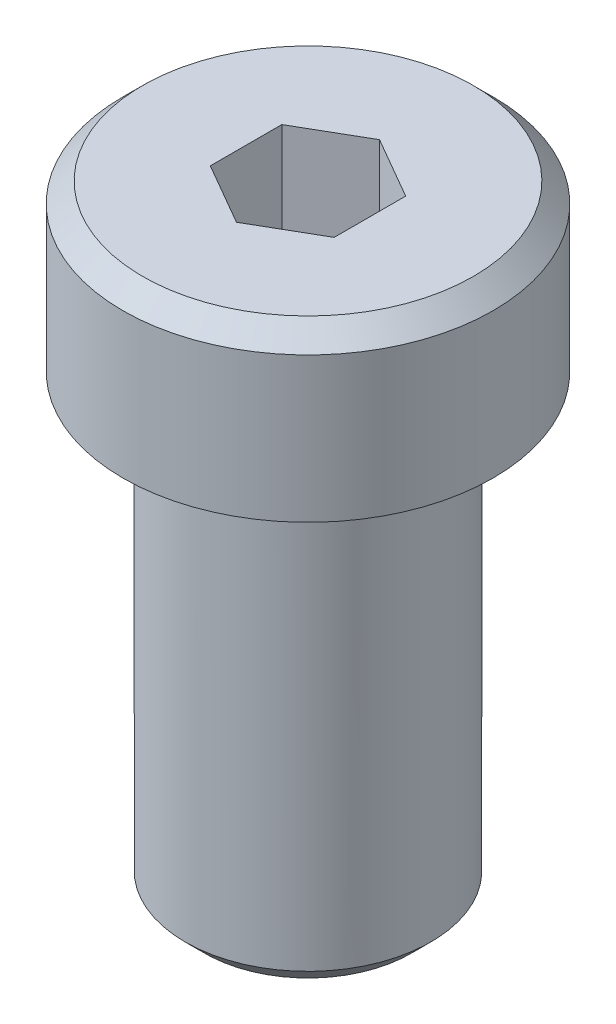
ISO-10303-21;
HEADER;
FILE_DESCRIPTION(('STEP AP214'),'2;1');
FILE_NAME('part.step','',(''),(''),'','','');
FILE_SCHEMA(('AUTOMOTIVE_DESIGN { 1 0 10303 214 1 1 1 1 }'));
ENDSEC;
DATA;
#1=APPLICATION_CONTEXT('core data for automotive mechanical design processes');
#2=APPLICATION_PROTOCOL_DEFINITION('international standard','automotive_design',2000,#1);
#3=PRODUCT_CONTEXT('',#1,'mechanical');
#4=PRODUCT('Part','Part','',(#3));
#5=PRODUCT_RELATED_PRODUCT_CATEGORY('part','',(#4));
#6=PRODUCT_DEFINITION_FORMATION('','',#4);
#7=PRODUCT_DEFINITION_CONTEXT('part definition',#1,'design');
#8=PRODUCT_DEFINITION('design','',#6,#7);
#9=PRODUCT_DEFINITION_SHAPE('','',#8);
#10=(LENGTH_UNIT() NAMED_UNIT(*) SI_UNIT(.MILLI.,.METRE.));
#11=(NAMED_UNIT(*) PLANE_ANGLE_UNIT() SI_UNIT($,.RADIAN.));
#12=(NAMED_UNIT(*) SI_UNIT($,.STERADIAN.) SOLID_ANGLE_UNIT());
#13=UNCERTAINTY_MEASURE_WITH_UNIT(LENGTH_MEASURE(1.E-05),#10,'distance_accuracy_value','');
#14=(GEOMETRIC_REPRESENTATION_CONTEXT(3) GLOBAL_UNCERTAINTY_ASSIGNED_CONTEXT((#13)) GLOBAL_UNIT_ASSIGNED_CONTEXT((#10,
#11,#12)) REPRESENTATION_CONTEXT('',''));
#15=CARTESIAN_POINT('',(0.,0.,0.));
#16=DIRECTION('',(0.,0.,1.));
#17=DIRECTION('',(1.,0.,0.));
#18=AXIS2_PLACEMENT_3D('',#15,#16,#17);
#19=CARTESIAN_POINT('',(0.,0.,0.));
#20=DIRECTION('',(0.,-1.,0.));
#21=DIRECTION('',(1.,0.,0.));
#22=AXIS2_PLACEMENT_3D('',#19,#20,#21);
#23=PLANE('',#22);
#24=CARTESIAN_POINT('',(0.,0.,0.));
#25=DIRECTION('',(0.,-1.,0.));
#26=DIRECTION('',(1.,0.,0.));
#27=AXIS2_PLACEMENT_3D('',#24,#25,#26);
#28=CIRCLE('',#27,4.7371);
#29=CARTESIAN_POINT('',(4.7371,0.,0.));
#30=VERTEX_POINT('',#29);
#31=EDGE_CURVE('E148',#30,#30,#28,.T.);
#32=ORIENTED_EDGE('',*,*,#31,.F.);
#33=EDGE_LOOP('',(#32));
#34=FACE_BOUND('',#33,.T.);
#35=CARTESIAN_POINT('',(0.,0.,0.));
#36=DIRECTION('',(0.,-1.,0.));
#37=DIRECTION('',(1.,0.,0.));
#38=AXIS2_PLACEMENT_3D('',#35,#36,#37);
#39=CIRCLE('',#38,7.137393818);
#40=CARTESIAN_POINT('',(7.137393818,0.,0.));
#41=VERTEX_POINT('',#40);
#42=EDGE_CURVE('E145',#41,#41,#39,.T.);
#43=ORIENTED_EDGE('',*,*,#42,.T.);
#44=EDGE_LOOP('',(#43));
#45=FACE_BOUND('',#44,.T.);
#46=ADVANCED_FACE('F32',(#34,#45),#23,.T.);
#47=CARTESIAN_POINT('',(0.,0.,0.));
#48=DIRECTION('',(0.,-1.,0.));
#49=DIRECTION('',(1.,0.,0.));
#50=AXIS2_PLACEMENT_3D('',#47,#48,#49);
#51=CYLINDRICAL_SURFACE('',#50,7.137393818);
#52=CARTESIAN_POINT('',(0.,5.5879945,0.));
#53=DIRECTION('',(0.,-1.,0.));
#54=DIRECTION('',(1.,0.,0.));
#55=AXIS2_PLACEMENT_3D('',#52,#53,#54);
#56=CIRCLE('',#55,7.137393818);
#57=CARTESIAN_POINT('',(7.137393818,5.5879945,0.));
#58=VERTEX_POINT('',#57);
#59=EDGE_CURVE('E142',#58,#58,#56,.T.);
#60=ORIENTED_EDGE('',*,*,#59,.T.);
#61=EDGE_LOOP('',(#60));
#62=FACE_BOUND('',#61,.T.);
#63=ORIENTED_EDGE('',*,*,#42,.F.);
#64=EDGE_LOOP('',(#63));
#65=FACE_BOUND('',#64,.T.);
#66=ADVANCED_FACE('F164',(#62,#65),#51,.T.);
#67=CARTESIAN_POINT('',(0.,5.5879945,0.));
#68=DIRECTION('',(0.,-1.,0.));
#69=DIRECTION('',(1.,0.,0.));
#70=AXIS2_PLACEMENT_3D('',#67,#68,#69);
#71=CONICAL_SURFACE('',#70,7.137393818,0.785398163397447);
#72=CARTESIAN_POINT('',(0.,6.3499945,0.));
#73=DIRECTION('',(0.,-1.,0.));
#74=DIRECTION('',(1.,0.,0.));
#75=AXIS2_PLACEMENT_3D('',#72,#73,#74);
#76=CIRCLE('',#75,6.375393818);
#77=CARTESIAN_POINT('',(6.375393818,6.3499945,0.));
#78=VERTEX_POINT('',#77);
#79=EDGE_CURVE('E134',#78,#78,#76,.T.);
#80=ORIENTED_EDGE('',*,*,#79,.T.);
#81=EDGE_LOOP('',(#80));
#82=FACE_BOUND('',#81,.T.);
#83=ORIENTED_EDGE('',*,*,#59,.F.);
#84=EDGE_LOOP('',(#83));
#85=FACE_BOUND('',#84,.T.);
#86=ADVANCED_FACE('F169',(#82,#85),#71,.T.);
#87=CARTESIAN_POINT('',(6.375393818,6.3499945,0.));
#88=DIRECTION('',(0.,1.,0.));
#89=DIRECTION('',(-1.,0.,0.));
#90=AXIS2_PLACEMENT_3D('',#87,#88,#89);
#91=PLANE('',#90);
#92=DIRECTION('',(-4.53589793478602E-07,0.,0.999999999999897));
#93=VECTOR('',#92,1.);
#94=CARTESIAN_POINT('',(-2.38759668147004,6.3499945,-1.37848223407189));
#95=LINE('',#94,#93);
#96=CARTESIAN_POINT('',(-2.38759668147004,6.3499945,-1.37848223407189));
#97=VERTEX_POINT('',#96);
#98=CARTESIAN_POINT('',(-2.387597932,6.3499945,1.37848006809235));
#99=VERTEX_POINT('',#98);
#100=EDGE_CURVE('E47',#97,#99,#95,.T.);
#101=ORIENTED_EDGE('',*,*,#100,.F.);
#102=DIRECTION('',(-0.866025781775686,0.,0.499999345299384));
#103=VECTOR('',#102,1.);
#104=CARTESIAN_POINT('',(1.87579371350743E-06,6.3499945,-2.75696049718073));
#105=LINE('',#104,#103);
#106=CARTESIAN_POINT('',(1.87579371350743E-06,6.3499945,-2.75696049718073));
#107=VERTEX_POINT('',#106);
#108=EDGE_CURVE('E130',#107,#97,#105,.T.);
#109=ORIENTED_EDGE('',*,*,#108,.F.);
#110=DIRECTION('',(-0.866025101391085,0.,-0.500000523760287));
#111=VECTOR('',#110,1.);
#112=CARTESIAN_POINT('',(2.38759855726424,6.3499945,-1.37847898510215));
#113=LINE('',#112,#111);
#114=CARTESIAN_POINT('',(2.38759855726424,6.3499945,-1.37847898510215));
#115=VERTEX_POINT('',#114);
#116=EDGE_CURVE('E128',#115,#107,#113,.T.);
#117=ORIENTED_EDGE('',*,*,#116,.F.);
#118=DIRECTION('',(4.53589793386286E-07,0.,-0.999999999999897));
#119=VECTOR('',#118,1.);
#120=CARTESIAN_POINT('',(2.38759730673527,6.3499945,1.37848115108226));
#121=LINE('',#120,#119);
#122=CARTESIAN_POINT('',(2.38759730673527,6.3499945,1.37848115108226));
#123=VERTEX_POINT('',#122);
#124=EDGE_CURVE('E95',#123,#115,#121,.T.);
#125=ORIENTED_EDGE('',*,*,#124,.F.);
#126=DIRECTION('',(0.866025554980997,0.,-0.499999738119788));
#127=VECTOR('',#126,1.);
#128=CARTESIAN_POINT('',(-6.25264571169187E-07,6.3499945,2.7569604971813));
#129=LINE('',#128,#127);
#130=CARTESIAN_POINT('',(-6.25264571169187E-07,6.3499945,2.7569604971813));
#131=VERTEX_POINT('',#130);
#132=EDGE_CURVE('E124',#131,#123,#129,.T.);
#133=ORIENTED_EDGE('',*,*,#132,.F.);
#134=DIRECTION('',(0.86602532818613,0.,0.500000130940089));
#135=VECTOR('',#134,1.);
#136=CARTESIAN_POINT('',(-2.387597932,6.3499945,1.37848006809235));
#137=LINE('',#136,#135);
#138=EDGE_CURVE('E121',#99,#131,#137,.T.);
#139=ORIENTED_EDGE('',*,*,#138,.F.);
#140=EDGE_LOOP('',(#101,#109,#117,#125,#133,#139));
#141=FACE_BOUND('',#140,.T.);
#142=ORIENTED_EDGE('',*,*,#79,.F.);
#143=EDGE_LOOP('',(#142));
#144=FACE_BOUND('',#143,.T.);
#145=ADVANCED_FACE('F177',(#141,#144),#91,.T.);
#146=CARTESIAN_POINT('',(0.,-17.4498,0.));
#147=DIRECTION('',(0.,-1.,0.));
#148=DIRECTION('',(0.,0.,-1.));
#149=AXIS2_PLACEMENT_3D('',#146,#147,#148);
#150=PLANE('',#149);
#151=CARTESIAN_POINT('',(0.,-17.4498,0.));
#152=DIRECTION('',(0.,-1.,0.));
#153=DIRECTION('',(0.,0.,-1.));
#154=AXIS2_PLACEMENT_3D('',#151,#152,#153);
#155=CIRCLE('',#154,3.9751);
#156=CARTESIAN_POINT('',(0.,-17.4498,-3.9751));
#157=VERTEX_POINT('',#156);
#158=EDGE_CURVE('E40',#157,#157,#155,.T.);
#159=ORIENTED_EDGE('',*,*,#158,.T.);
#160=EDGE_LOOP('',(#159));
#161=FACE_BOUND('',#160,.T.);
#162=ADVANCED_FACE('F153',(#161),#150,.T.);
#163=CARTESIAN_POINT('',(0.,0.,0.));
#164=DIRECTION('',(0.,-1.,0.));
#165=DIRECTION('',(0.,0.,-1.));
#166=AXIS2_PLACEMENT_3D('',#163,#164,#165);
#167=CYLINDRICAL_SURFACE('',#166,4.7371);
#168=CARTESIAN_POINT('',(0.,-16.6878,0.));
#169=DIRECTION('',(0.,-1.,0.));
#170=DIRECTION('',(0.,0.,-1.));
#171=AXIS2_PLACEMENT_3D('',#168,#169,#170);
#172=CIRCLE('',#171,4.7371);
#173=CARTESIAN_POINT('',(0.,-16.6878,-4.7371));
#174=VERTEX_POINT('',#173);
#175=EDGE_CURVE('E11',#174,#174,#172,.F.);
#176=ORIENTED_EDGE('',*,*,#175,.T.);
#177=EDGE_LOOP('',(#176));
#178=FACE_BOUND('',#177,.T.);
#179=ORIENTED_EDGE('',*,*,#31,.T.);
#180=EDGE_LOOP('',(#179));
#181=FACE_BOUND('',#180,.T.);
#182=ADVANCED_FACE('F184',(#178,#181),#167,.T.);
#183=CARTESIAN_POINT('',(-2.38759668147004,2.768597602,-1.37848223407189));
#184=DIRECTION('',(-0.999999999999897,0.,-4.53589793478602E-07));
#185=DIRECTION('',(-4.53589793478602E-07,0.,0.999999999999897));
#186=AXIS2_PLACEMENT_3D('',#183,#184,#185);
#187=PLANE('',#186);
#188=ORIENTED_EDGE('',*,*,#100,.T.);
#189=DIRECTION('',(0.,1.,0.));
#190=VECTOR('',#189,1.);
#191=CARTESIAN_POINT('',(-2.387597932,2.768597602,1.37848006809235));
#192=LINE('',#191,#190);
#193=CARTESIAN_POINT('',(-2.387597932,2.768597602,1.37848006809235));
#194=VERTEX_POINT('',#193);
#195=EDGE_CURVE('E77',#194,#99,#192,.T.);
#196=ORIENTED_EDGE('',*,*,#195,.F.);
#197=DIRECTION('',(-4.53589793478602E-07,0.,0.999999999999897));
#198=VECTOR('',#197,1.);
#199=CARTESIAN_POINT('',(-2.38759668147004,2.768597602,-1.37848223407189));
#200=LINE('',#199,#198);
#201=CARTESIAN_POINT('',(-2.38759668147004,2.768597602,-1.37848223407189));
#202=VERTEX_POINT('',#201);
#203=EDGE_CURVE('E132',#202,#194,#200,.T.);
#204=ORIENTED_EDGE('',*,*,#203,.F.);
#205=DIRECTION('',(0.,1.,0.));
#206=VECTOR('',#205,1.);
#207=CARTESIAN_POINT('',(-2.38759668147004,2.768597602,-1.37848223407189));
#208=LINE('',#207,#206);
#209=EDGE_CURVE('E55',#202,#97,#208,.T.);
#210=ORIENTED_EDGE('',*,*,#209,.T.);
#211=EDGE_LOOP('',(#188,#196,#204,#210));
#212=FACE_BOUND('',#211,.T.);
#213=ADVANCED_FACE('F187',(#212),#187,.F.);
#214=CARTESIAN_POINT('',(1.87579371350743E-06,2.768597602,-2.75696049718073));
#215=DIRECTION('',(-0.499999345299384,0.,-0.866025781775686));
#216=DIRECTION('',(-0.866025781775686,0.,0.499999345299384));
#217=AXIS2_PLACEMENT_3D('',#214,#215,#216);
#218=PLANE('',#217);
#219=ORIENTED_EDGE('',*,*,#108,.T.);
#220=ORIENTED_EDGE('',*,*,#209,.F.);
#221=DIRECTION('',(-0.866025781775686,0.,0.499999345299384));
#222=VECTOR('',#221,1.);
#223=CARTESIAN_POINT('',(1.87579371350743E-06,2.768597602,-2.75696049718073));
#224=LINE('',#223,#222);
#225=CARTESIAN_POINT('',(1.87579371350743E-06,2.768597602,-2.75696049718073));
#226=VERTEX_POINT('',#225);
#227=EDGE_CURVE('E107',#226,#202,#224,.T.);
#228=ORIENTED_EDGE('',*,*,#227,.F.);
#229=DIRECTION('',(0.,1.,0.));
#230=VECTOR('',#229,1.);
#231=CARTESIAN_POINT('',(1.87579371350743E-06,2.768597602,-2.75696049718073));
#232=LINE('',#231,#230);
#233=EDGE_CURVE('E99',#226,#107,#232,.T.);
#234=ORIENTED_EDGE('',*,*,#233,.T.);
#235=EDGE_LOOP('',(#219,#220,#228,#234));
#236=FACE_BOUND('',#235,.T.);
#237=ADVANCED_FACE('F191',(#236),#218,.F.);
#238=CARTESIAN_POINT('',(2.38759855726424,2.768597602,-1.37847898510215));
#239=DIRECTION('',(0.500000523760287,0.,-0.866025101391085));
#240=DIRECTION('',(-0.866025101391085,0.,-0.500000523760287));
#241=AXIS2_PLACEMENT_3D('',#238,#239,#240);
#242=PLANE('',#241);
#243=ORIENTED_EDGE('',*,*,#116,.T.);
#244=ORIENTED_EDGE('',*,*,#233,.F.);
#245=DIRECTION('',(-0.866025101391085,0.,-0.500000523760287));
#246=VECTOR('',#245,1.);
#247=CARTESIAN_POINT('',(2.38759855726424,2.768597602,-1.37847898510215));
#248=LINE('',#247,#246);
#249=CARTESIAN_POINT('',(2.38759855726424,2.768597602,-1.37847898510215));
#250=VERTEX_POINT('',#249);
#251=EDGE_CURVE('E103',#250,#226,#248,.T.);
#252=ORIENTED_EDGE('',*,*,#251,.F.);
#253=DIRECTION('',(0.,1.,0.));
#254=VECTOR('',#253,1.);
#255=CARTESIAN_POINT('',(2.38759855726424,2.768597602,-1.37847898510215));
#256=LINE('',#255,#254);
#257=EDGE_CURVE('E88',#250,#115,#256,.T.);
#258=ORIENTED_EDGE('',*,*,#257,.T.);
#259=EDGE_LOOP('',(#243,#244,#252,#258));
#260=FACE_BOUND('',#259,.T.);
#261=ADVANCED_FACE('F104',(#260),#242,.F.);
#262=CARTESIAN_POINT('',(2.38759730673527,2.768597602,1.37848115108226));
#263=DIRECTION('',(0.999999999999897,0.,4.53589793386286E-07));
#264=DIRECTION('',(4.53589793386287E-07,0.,-0.999999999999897));
#265=AXIS2_PLACEMENT_3D('',#262,#263,#264);
#266=PLANE('',#265);
#267=ORIENTED_EDGE('',*,*,#124,.T.);
#268=ORIENTED_EDGE('',*,*,#257,.F.);
#269=DIRECTION('',(4.53589793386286E-07,0.,-0.999999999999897));
#270=VECTOR('',#269,1.);
#271=CARTESIAN_POINT('',(2.38759730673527,2.768597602,1.37848115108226));
#272=LINE('',#271,#270);
#273=CARTESIAN_POINT('',(2.38759730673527,2.768597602,1.37848115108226));
#274=VERTEX_POINT('',#273);
#275=EDGE_CURVE('E92',#274,#250,#272,.T.);
#276=ORIENTED_EDGE('',*,*,#275,.F.);
#277=DIRECTION('',(0.,1.,0.));
#278=VECTOR('',#277,1.);
#279=CARTESIAN_POINT('',(2.38759730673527,2.768597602,1.37848115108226));
#280=LINE('',#279,#278);
#281=EDGE_CURVE('E100',#274,#123,#280,.T.);
#282=ORIENTED_EDGE('',*,*,#281,.T.);
#283=EDGE_LOOP('',(#267,#268,#276,#282));
#284=FACE_BOUND('',#283,.T.);
#285=ADVANCED_FACE('F90',(#284),#266,.F.);
#286=CARTESIAN_POINT('',(-6.25264571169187E-07,2.768597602,2.7569604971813));
#287=DIRECTION('',(0.499999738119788,0.,0.866025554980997));
#288=DIRECTION('',(0.866025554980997,0.,-0.499999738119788));
#289=AXIS2_PLACEMENT_3D('',#286,#287,#288);
#290=PLANE('',#289);
#291=ORIENTED_EDGE('',*,*,#132,.T.);
#292=ORIENTED_EDGE('',*,*,#281,.F.);
#293=DIRECTION('',(0.866025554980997,0.,-0.499999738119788));
#294=VECTOR('',#293,1.);
#295=CARTESIAN_POINT('',(-6.25264571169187E-07,2.768597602,2.7569604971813));
#296=LINE('',#295,#294);
#297=CARTESIAN_POINT('',(-6.25264571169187E-07,2.768597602,2.7569604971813));
#298=VERTEX_POINT('',#297);
#299=EDGE_CURVE('E113',#298,#274,#296,.T.);
#300=ORIENTED_EDGE('',*,*,#299,.F.);
#301=DIRECTION('',(0.,1.,0.));
#302=VECTOR('',#301,1.);
#303=CARTESIAN_POINT('',(-6.25264571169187E-07,2.768597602,2.7569604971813));
#304=LINE('',#303,#302);
#305=EDGE_CURVE('E137',#298,#131,#304,.T.);
#306=ORIENTED_EDGE('',*,*,#305,.T.);
#307=EDGE_LOOP('',(#291,#292,#300,#306));
#308=FACE_BOUND('',#307,.T.);
#309=ADVANCED_FACE('F194',(#308),#290,.F.);
#310=CARTESIAN_POINT('',(-2.387597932,2.768597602,1.37848006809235));
#311=DIRECTION('',(-0.500000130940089,0.,0.86602532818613));
#312=DIRECTION('',(0.86602532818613,0.,0.500000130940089));
#313=AXIS2_PLACEMENT_3D('',#310,#311,#312);
#314=PLANE('',#313);
#315=ORIENTED_EDGE('',*,*,#138,.T.);
#316=ORIENTED_EDGE('',*,*,#305,.F.);
#317=DIRECTION('',(0.86602532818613,0.,0.500000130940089));
#318=VECTOR('',#317,1.);
#319=CARTESIAN_POINT('',(-2.387597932,2.768597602,1.37848006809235));
#320=LINE('',#319,#318);
#321=EDGE_CURVE('E115',#194,#298,#320,.T.);
#322=ORIENTED_EDGE('',*,*,#321,.F.);
#323=ORIENTED_EDGE('',*,*,#195,.T.);
#324=EDGE_LOOP('',(#315,#316,#322,#323));
#325=FACE_BOUND('',#324,.T.);
#326=ADVANCED_FACE('F160',(#325),#314,.F.);
#327=CARTESIAN_POINT('',(-2.387597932,2.768597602,1.37848006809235));
#328=DIRECTION('',(0.,1.,0.));
#329=DIRECTION('',(0.,0.,1.));
#330=AXIS2_PLACEMENT_3D('',#327,#328,#329);
#331=PLANE('',#330);
#332=ORIENTED_EDGE('',*,*,#203,.T.);
#333=ORIENTED_EDGE('',*,*,#321,.T.);
#334=ORIENTED_EDGE('',*,*,#299,.T.);
#335=ORIENTED_EDGE('',*,*,#275,.T.);
#336=ORIENTED_EDGE('',*,*,#251,.T.);
#337=ORIENTED_EDGE('',*,*,#227,.T.);
#338=EDGE_LOOP('',(#332,#333,#334,#335,#336,#337));
#339=FACE_BOUND('',#338,.T.);
#340=ADVANCED_FACE('F110',(#339),#331,.T.);
#341=CARTESIAN_POINT('',(0.,-17.4498,0.));
#342=DIRECTION('',(0.,1.,0.));
#343=DIRECTION('',(0.,0.,1.));
#344=AXIS2_PLACEMENT_3D('',#341,#342,#343);
#345=CONICAL_SURFACE('',#344,3.9751,0.785398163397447);
#346=ORIENTED_EDGE('',*,*,#175,.F.);
#347=EDGE_LOOP('',(#346));
#348=FACE_BOUND('',#347,.T.);
#349=ORIENTED_EDGE('',*,*,#158,.F.);
#350=EDGE_LOOP('',(#349));
#351=FACE_BOUND('',#350,.T.);
#352=ADVANCED_FACE('F34',(#348,#351),#345,.T.);
#353=CLOSED_SHELL('',(#46,#66,#86,#145,#162,#182,#213,#237,#261,#285,#309,#326,#340,#352));
#354=MANIFOLD_SOLID_BREP('B2',#353);
#355=ADVANCED_BREP_SHAPE_REPRESENTATION('',(#18,#354),#14);
#356=SHAPE_DEFINITION_REPRESENTATION(#9,#355);
ENDSEC;
END-ISO-10303-21;
